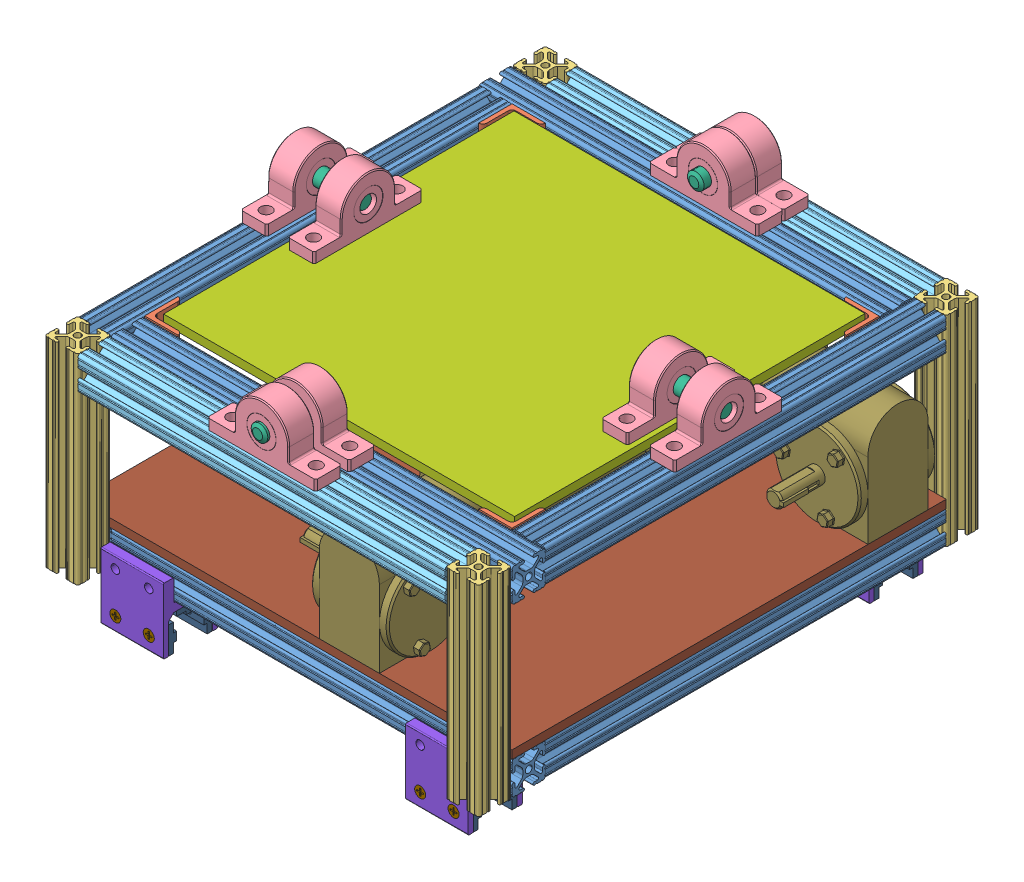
SolidWorks assembly Platform doneishish.SLDASM, configuration Default (file format 9000). Lengths in mm.
Overall size (330.24 225.54 383.98).
83 component instances, 12 part files, 93 mates.
Components (placement in the parent):
- Beams12in-4: Beams12in.sldprt [Default] at (271.7397 349.7495 462.1687) x (0 0 -1) z (1 0 0) size (25.4 25.4 304.8)
- Beams12in-5: Beams12in.sldprt [Default] at (259.0397 349.7495 144.6687) x (-1 0 0) z (0 0 -1) size (25.4 25.4 304.8)
- Beams12in-6: Beams12in.sldprt [Default] at (-45.7603 349.7495 170.0687) x (-1 0 0) z (0 0 -1) size (25.4 25.4 304.8)
- Beams12in-7: Beams12in.sldprt [Default] at (246.3397 349.7495 157.3687) x (0 0 -1) z (1 0 0) size (25.4 25.4 304.8)
- Corner bracket-1: Corner bracket.sldprt [Default] at (246.3397 349.7495 449.4687) x (0 -1 0) z (0 0 -1) size (25.4 25.4 25.4)
- Corner bracket-2: Corner bracket.sldprt [Default] at (-33.0603 349.7495 170.0687) x (0 1 0) z (1 0 0) size (25.4 25.4 25.4)
- Corner bracket-3: Corner bracket.sldprt [Default] at (246.3397 349.7495 170.0687) x (0 1 0) z (0 0 1) size (25.4 25.4 25.4)
- Corner bracket-4: Corner bracket.sldprt [Default] at (-33.0603 349.7495 449.4687) x (0 -1 0) z (1 0 0) size (25.4 25.4 25.4)
- Platform2-1: Platform2.SLDASM [Default] at (271.7213 476.6542 462.1369) x (0 0 -1) z (1 -0.000577 0) size (330.2 25.4 330.2)
  - Beams12in-7: Beams12in.sldprt [Default] at origin size (25.4 25.4 304.8)
  - Beams12in-5: Beams12in.sldprt [Default] at (317.5 0 -12.7) x (0 0 -1) z (1 0 0) size (25.4 25.4 304.8)
  - Beams12in-6: Beams12in.sldprt [Default] at (292.1 0 -317.5) x (0 0 -1) z (1 0 0) size (25.4 25.4 304.8)
  - Beams12in-8: Beams12in.sldprt [Default] at (304.8 0 -25.4) size (25.4 25.4 304.8)
  - Corner bracket-1: Corner bracket.sldprt [Default] at (12.7 0 -25.4) x (0 -1 0) z (1 0 0) size (25.4 25.4 25.4)
  - Corner bracket-2: Corner bracket.sldprt [Default] at (292.1 0 -304.8) x (0 1 0) z (0 0 1) size (25.4 25.4 25.4)
  - Corner bracket-3: Corner bracket.sldprt [Default] at (292.1 0 -25.4) x (0 1 0) z (-1 0 0) size (25.4 25.4 25.4)
  - Corner bracket-4: Corner bracket.sldprt [Default] at (12.7 0 -304.8) x (0 -1 0) z (0 0 1) size (25.4 25.4 25.4)
- Beams6in-1: Beams6in.sldprt [Default] at (259.0397 184.6495 131.9687) x (0 0 -1) z (0 -1 0) size (25.4 25.4 152.4)
- Beams6in-2: Beams6in.sldprt [Default] at (259.0397 184.6495 487.5687) x (0 0 -1) z (0 -1 0) size (25.4 25.4 152.4)
- Sleeve bearing 05diameter-1: Sleeve bearing 05diameter.SLDPRT [2820T6] at (106.6397 508.4995 154.5588) x (-1 0.000577 0) z (0 0 -1) size (82.55 39.69 19.84)
- Sleeve bearing 05diameter-2: Sleeve bearing 05diameter.SLDPRT [2820T6] at (106.6397 508.4995 464.915) x (1 -0.000577 0) z (0 0 1) size (82.55 39.69 19.84)
- Beams6in-3: Beams6in.sldprt [Default] at (-45.7603 184.6495 131.9687) x (0 0 -1) z (0 -1 0) size (25.4 25.4 152.4)
- Beams6in-4: Beams6in.sldprt [Default] at (-45.7603 184.6495 487.5687) x (0 0 -1) z (0 -1 0) size (25.4 25.4 152.4)
- Beams11in-6: Beams11in.sldprt [Default] at (271.7397 476.7495 487.5687) x (0 0 -1) z (1 0 0) size (25.4 25.4 279.4)
- Beams11in-7: Beams11in.sldprt [Default] at (271.7397 476.7495 131.9687) x (0 0 -1) z (1 0 0) size (25.4 25.4 279.4)
- Sleeve bearing 05diameter-3: Sleeve bearing 05diameter.SLDPRT [2820T6] at (106.6397 508.4995 490.3468) x (-1 0 0) z (0 0 -1) size (82.55 39.69 19.84)
- Sleeve bearing 05diameter-4: Sleeve bearing 05diameter.SLDPRT [2820T6] at (106.6397 508.4995 134.7468) x (-1 0 0) z (0 0 -1) size (82.55 39.69 19.84)
- Rod-1: Rod.SLDPRT [Default] at (106.6397 508.4995 503.2532) x (0.451188 0.892429 0) z (0 0 -1) size (12.7 12.7 50.8)
- Rod-2: Rod.SLDPRT [Default] at (106.6397 508.4995 171.5164) x (-0.988826 0.149076 0) z (0 0 -1) size (12.7 12.7 50.8)
- Sleeve bearing 05diameter-5: Sleeve bearing 05diameter.SLDPRT [2820T6] at (261.8178 508.4099 309.7687) x (0 0 -1) z (1 -0.000577 0) size (82.55 39.69 19.84)
- Sleeve bearing 05diameter-6: Sleeve bearing 05diameter.SLDPRT [2820T6] at (-48.5384 508.5891 309.7687) x (0 0 -1) z (1 -0.000577 0) size (82.55 39.69 19.84)
- Sleeve bearing 05diameter-7: Sleeve bearing 05diameter.SLDPRT [2820T6] at (225.7815 508.4307 309.7687) x (0.000001 0.001168 -0.999999) z (1 -0.000577 0) size (82.55 39.69 19.84)
- Sleeve bearing 05diameter-8: Sleeve bearing 05diameter.SLDPRT [2820T6] at (-12.5022 508.5683 309.7687) x (0.000001 0.001168 -0.999999) z (1 -0.000577 0) size (82.55 39.69 19.84)
- Rod-3: Rod.SLDPRT [Default] at (218.3997 508.435 309.7687) x (0.000225 0.390504 -0.920601) z (1 -0.000577 0) size (12.7 12.7 50.8)
- Rod-4: Rod.SLDPRT [Default] at (-55.9203 508.5933 309.7687) x (-0.000111 -0.191908 -0.981413) z (1 -0.000577 0) size (12.7 12.7 50.8)
- Plate-1: Plate.SLDPRT [Default] at (106.0122 483.1026 307.3752) x (-0.000787 0.001168 -0.999999) z (1 -0.000576 -0.000788) size (266.7 6.35 266.7)
- Linearbearing-1: Linearbearing.sldasm [Default] at (222.5272 314.0371 462.1687) x (0 0 -1) z (1 0 0) size (41.25 49.99 47.63)
  - _6715_p_2-1: _6715_p_2.sldprt [Default] at origin size (41.25 49.99 47.63)
  - _3625__4-1: _3625__4.sldprt [Default] at (-18.973 0 12.6873) x (0 0 -1) z (0 -1 0) size (8.43 1.79 8.43)
  - _3625__4-2: _3625__4.sldprt [Default] at (-18.973 0 -12.7127) x (0 0 -1) z (0 -1 0) size (8.43 1.79 8.43)
  - _3625__4-3: _3625__4.sldprt [Default] at (18.973 0 12.6873) x (0 0 -1) z (0 1 0) size (8.43 1.79 8.43)
  - _3625__4-4: _3625__4.sldprt [Default] at (18.973 0 -12.7127) x (0 0 -1) z (0 1 0) size (8.43 1.79 8.43)
  - _3625__4-5: _3625__4.sldprt [Default] at (0 19.5826 12.6873) x (1 0 0) z (0 0 -1) size (8.43 1.79 8.43)
  - _3625__4-6: _3625__4.sldprt [Default] at (0 19.5826 -12.7127) x (1 0 0) z (0 0 -1) size (8.43 1.79 8.43)
  - _6790_11-1: _6790_11.sldprt [Default] at (-12.8524 0 -0.0254) x (0 0 -1) z (1 0 0) size (47.37 20.62 6.35)
  - _6790_11-2: _6790_11.sldprt [Default] at (12.8524 0 -0.0254) x (0 0 -1) z (-1 0 0) size (47.37 20.62 6.35)
  - _6790_11-3: _6790_11.sldprt [Default] at (0 12.8524 -0.0254) x (0 0 -1) z (0 -1 0) size (47.37 20.62 6.35)
- Linearbearing-2: Linearbearing.sldasm [Default] at (-9.2478 314.0371 462.1687) x (0 0 -1) z (1 0 0) size (41.25 49.99 47.63)
  - _6715_p_2-1: _6715_p_2.sldprt [Default] at origin size (41.25 49.99 47.63)
  - _3625__4-1: _3625__4.sldprt [Default] at (-18.973 0 12.6873) x (0 0 -1) z (0 -1 0) size (8.43 1.79 8.43)
  - _3625__4-2: _3625__4.sldprt [Default] at (-18.973 0 -12.7127) x (0 0 -1) z (0 -1 0) size (8.43 1.79 8.43)
  - _3625__4-3: _3625__4.sldprt [Default] at (18.973 0 12.6873) x (0 0 -1) z (0 1 0) size (8.43 1.79 8.43)
  - _3625__4-4: _3625__4.sldprt [Default] at (18.973 0 -12.7127) x (0 0 -1) z (0 1 0) size (8.43 1.79 8.43)
  - _3625__4-5: _3625__4.sldprt [Default] at (0 19.5826 12.6873) x (1 0 0) z (0 0 -1) size (8.43 1.79 8.43)
  - _3625__4-6: _3625__4.sldprt [Default] at (0 19.5826 -12.7127) x (1 0 0) z (0 0 -1) size (8.43 1.79 8.43)
  - _6790_11-1: _6790_11.sldprt [Default] at (-12.8524 0 -0.0254) x (0 0 -1) z (1 0 0) size (47.37 20.62 6.35)
  - _6790_11-2: _6790_11.sldprt [Default] at (12.8524 0 -0.0254) x (0 0 -1) z (-1 0 0) size (47.37 20.62 6.35)
  - _6790_11-3: _6790_11.sldprt [Default] at (0 12.8524 -0.0254) x (0 0 -1) z (0 -1 0) size (47.37 20.62 6.35)
- Linearbearing-3: Linearbearing.sldasm [Default] at (-9.2478 314.0371 157.3687) x (0 0 1) z (-1 0 0) size (41.25 49.99 47.63)
  - _6715_p_2-1: _6715_p_2.sldprt [Default] at origin size (41.25 49.99 47.63)
  - _3625__4-1: _3625__4.sldprt [Default] at (-18.973 0 12.6873) x (0 0 -1) z (0 -1 0) size (8.43 1.79 8.43)
  - _3625__4-2: _3625__4.sldprt [Default] at (-18.973 0 -12.7127) x (0 0 -1) z (0 -1 0) size (8.43 1.79 8.43)
  - _3625__4-3: _3625__4.sldprt [Default] at (18.973 0 12.6873) x (0 0 -1) z (0 1 0) size (8.43 1.79 8.43)
  - _3625__4-4: _3625__4.sldprt [Default] at (18.973 0 -12.7127) x (0 0 -1) z (0 1 0) size (8.43 1.79 8.43)
  - _3625__4-5: _3625__4.sldprt [Default] at (0 19.5826 12.6873) x (1 0 0) z (0 0 -1) size (8.43 1.79 8.43)
  - _3625__4-6: _3625__4.sldprt [Default] at (0 19.5826 -12.7127) x (1 0 0) z (0 0 -1) size (8.43 1.79 8.43)
  - _6790_11-1: _6790_11.sldprt [Default] at (-12.8524 0 -0.0254) x (0 0 -1) z (1 0 0) size (47.37 20.62 6.35)
  - _6790_11-2: _6790_11.sldprt [Default] at (12.8524 0 -0.0254) x (0 0 -1) z (-1 0 0) size (47.37 20.62 6.35)
  - _6790_11-3: _6790_11.sldprt [Default] at (0 12.8524 -0.0254) x (0 0 -1) z (0 -1 0) size (47.37 20.62 6.35)
- Linearbearing-4: Linearbearing.sldasm [Default] at (222.5272 314.0371 157.3687) x (0 0 1) z (-1 0 0) size (41.25 49.99 47.63)
  - _6715_p_2-1: _6715_p_2.sldprt [Default] at origin size (41.25 49.99 47.63)
  - _3625__4-1: _3625__4.sldprt [Default] at (-18.973 0 12.6873) x (0 0 -1) z (0 -1 0) size (8.43 1.79 8.43)
  - _3625__4-2: _3625__4.sldprt [Default] at (-18.973 0 -12.7127) x (0 0 -1) z (0 -1 0) size (8.43 1.79 8.43)
  - _3625__4-3: _3625__4.sldprt [Default] at (18.973 0 12.6873) x (0 0 -1) z (0 1 0) size (8.43 1.79 8.43)
  - _3625__4-4: _3625__4.sldprt [Default] at (18.973 0 -12.7127) x (0 0 -1) z (0 1 0) size (8.43 1.79 8.43)
  - _3625__4-5: _3625__4.sldprt [Default] at (0 19.5826 12.6873) x (1 0 0) z (0 0 -1) size (8.43 1.79 8.43)
  - _3625__4-6: _3625__4.sldprt [Default] at (0 19.5826 -12.7127) x (1 0 0) z (0 0 -1) size (8.43 1.79 8.43)
  - _6790_11-1: _6790_11.sldprt [Default] at (-12.8524 0 -0.0254) x (0 0 -1) z (1 0 0) size (47.37 20.62 6.35)
  - _6790_11-2: _6790_11.sldprt [Default] at (12.8524 0 -0.0254) x (0 0 -1) z (-1 0 0) size (47.37 20.62 6.35)
  - _6790_11-3: _6790_11.sldprt [Default] at (0 12.8524 -0.0254) x (0 0 -1) z (0 -1 0) size (47.37 20.62 6.35)
- bottom plate-1: bottom plate.SLDPRT [Default] at (106.6397 362.4495 309.7687) size (330.2 6.35 330.2)
- 59825K310_RIGHT-ANGLE SHAFT DC GEARMOTOR-1: 59825K310_RIGHT-ANGLE SHAFT DC GEARMOTOR.SLDPRT [59825K31] at (179.5377 427.2195 181.3098) size (223.17 90.17 100.08)
- 59825K310_RIGHT-ANGLE SHAFT DC GEARMOTOR-2: 59825K310_RIGHT-ANGLE SHAFT DC GEARMOTOR.SLDPRT [59825K31] at (148.0409 427.2195 382.6667) x (0 0 1) z (-1 0 0) size (223.17 90.17 100.08)
Mates (geometry in assembly coordinates):
- Coincident32: coincident anti-aligned: plane of bottom plate-1 through (106.6397 368.7995 309.7687) normal (0 1 0); plane of 59825K310_RIGHT-ANGLE SHAFT DC GEARMOTOR-1 through (271.7397 368.7995 204.1444) normal (0 -1 0)
- Coincident33: coincident anti-aligned: plane of bottom plate-1 through (106.6397 368.7995 309.7687) normal (0 1 0); plane of 59825K310_RIGHT-ANGLE SHAFT DC GEARMOTOR-2 through (125.2063 368.7995 474.8687) normal (0 -1 0)
- Coincident2: coincident anti-aligned: plane of Beams12in-4 through (-33.0603 356.0826 449.4687) normal (0 0 -1); plane of Corner bracket-1 through (246.3397 337.0495 449.4687) normal (0 0 1)
- Coincident34: coincident aligned: plane of Beams12in-4 through (-33.0603 362.4495 452.6183) normal (0 1 0); plane of Corner bracket-1 through (246.3397 362.4495 427.2437) normal (0 1 0)
- Coincident35: coincident anti-aligned: plane of Beams12in-4 through (-33.0603 356.0826 449.4687) normal (0 0 -1); plane of Beams12in-5 through (271.7397 339.6911 449.4687) normal (0 0 1)
- Coincident36: coincident aligned: plane of Beams12in-4 through (271.7397 339.6911 474.8687) normal (1 0 0); plane of Beams12in-5 through (271.7397 359.2999 449.4687) normal (1 0 0)
- Coincident37: coincident anti-aligned: plane of Beams12in-4 through (-33.0603 356.0826 449.4687) normal (0 0 -1); plane of Corner bracket-4 through (-7.6603 337.0495 449.4687) normal (0 0 1)
- Coincident38: coincident aligned: plane of Beams12in-4 through (-33.0603 362.4495 452.6183) normal (0 1 0); plane of Corner bracket-4 through (-10.8353 362.4495 449.4687) normal (0 1 0)
- Coincident40: coincident aligned: plane of Beams12in-4 through (-33.0603 337.0495 471.7191) normal (0 -1 0); plane of Beams6in-2 through (259.0397 337.0495 487.5687) normal (0 -1 0)
- Coincident41: coincident anti-aligned: plane of Beams12in-4 through (-33.0603 359.2999 474.8687) normal (0 0 1); plane of Beams6in-2 through (265.3728 489.4495 474.8687) normal (0 0 -1)
- Coincident45: coincident aligned: plane of Beams12in-4 through (271.7397 339.6911 474.8687) normal (1 0 0); plane of Beams6in-2 through (271.7397 489.4495 478.0183) normal (1 0 0)
- Coincident49: coincident anti-aligned: plane of Beams12in-4 through (-33.0603 359.2999 474.8687) normal (0 0 1); plane of Beams6in-4 through (-55.3107 489.4495 474.8687) normal (0 0 -1)
- Coincident4: coincident anti-aligned: plane of Beams12in-5 through (246.3397 356.0826 449.4687) normal (-1 0 0); plane of Corner bracket-1 through (246.3397 337.0495 424.0687) normal (1 0 0)
- Coincident50: coincident aligned: plane of Beams12in-5 through (249.4893 362.4495 449.4687) normal (0 1 0); plane of Corner bracket-1 through (246.3397 362.4495 427.2437) normal (0 1 0)
- Coincident51: coincident anti-aligned: plane of Beams12in-5 through (246.3397 356.0826 449.4687) normal (-1 0 0); plane of Beams12in-7 through (246.3397 339.6911 170.0687) normal (1 0 0)
- Coincident52: coincident aligned: plane of Beams12in-5 through (271.7397 339.6911 144.6687) normal (0 0 -1); plane of Beams12in-7 through (-58.4603 356.0826 144.6687) normal (0 0 -1)
- Coincident11: coincident aligned: plane of Beams12in-5 through (268.5901 337.0495 449.4687) normal (0 -1 0); plane of Beams12in-7 through (-58.4603 337.0495 151.0356) normal (0 -1 0)
- Coincident15: coincident anti-aligned: plane of Beams12in-5 through (246.3397 356.0826 449.4687) normal (-1 0 0); plane of Corner bracket-3 through (246.3397 362.4495 195.4687) normal (1 0 0)
- Coincident53: coincident aligned: plane of Beams12in-5 through (249.4893 362.4495 449.4687) normal (0 1 0); plane of Corner bracket-3 through (246.3397 362.4495 192.2937) normal (0 1 0)
- Coincident44: coincident aligned: plane of Beams12in-5 through (271.7397 343.4164 449.4687) normal (1 0 0); plane of Beams6in-1 through (271.7397 489.4495 138.3018) normal (1 0 0)
- Coincident54: coincident aligned: plane of Beams12in-6 through (-58.4603 356.0826 474.8687) normal (-1 0 0); plane of Beams12in-7 through (-58.4603 339.6911 170.0687) normal (-1 0 0)
- Coincident55: coincident anti-aligned: plane of Beams12in-6 through (-33.0603 339.6911 170.0687) normal (0 0 -1); plane of Beams12in-7 through (-58.4603 359.2999 170.0687) normal (0 0 1)
- Coincident56: coincident aligned: plane of Beams12in-6 through (-39.4272 362.4495 474.8687) normal (0 1 0); plane of Beams12in-7 through (-58.4603 362.4495 163.7018) normal (0 1 0)
- Coincident57: coincident anti-aligned: plane of Beams12in-6 through (-33.0603 359.2999 474.8687) normal (1 0 0); plane of Corner bracket-2 through (-33.0603 362.4495 170.0687) normal (-1 0 0)
- Coincident58: coincident anti-aligned: plane of Beams12in-6 through (-33.0603 359.2999 474.8687) normal (1 0 0); plane of Corner bracket-4 through (-33.0603 337.0495 449.4687) normal (-1 0 0)
- Coincident59: coincident aligned: plane of Beams12in-6 through (-58.4603 356.0826 474.8687) normal (-1 0 0); plane of Beams6in-4 through (-58.4603 489.4495 497.1191) normal (-1 0 0)
- Coincident60: coincident aligned: plane of Beams12in-6 through (-52.0934 337.0495 474.8687) normal (0 -1 0); plane of Beams6in-4 through (-45.7603 337.0495 487.5687) normal (0 -1 0)
- Coincident61: coincident anti-aligned: plane of Beams12in-7 through (-58.4603 359.2999 170.0687) normal (0 0 1); plane of Corner bracket-3 through (246.3397 362.4495 170.0687) normal (0 0 -1)
- Coincident62: coincident anti-aligned: plane of Beams12in-7 through (-58.4603 359.2999 170.0687) normal (0 0 1); plane of Corner bracket-2 through (-7.6603 362.4495 170.0687) normal (0 0 -1)
- Coincident63: coincident aligned: plane of Beams12in-7 through (-58.4603 362.4495 163.7018) normal (0 1 0); plane of Corner bracket-2 through (-10.8353 362.4495 170.0687) normal (0 1 0)
- Coincident42: coincident anti-aligned: plane of Beams12in-7 through (-58.4603 356.0826 144.6687) normal (0 0 -1); plane of Beams6in-1 through (268.5901 489.4495 144.6687) normal (0 0 1)
- Coincident43: coincident aligned: plane of Beams12in-7 through (-58.4603 337.0495 151.0356) normal (0 -1 0); plane of Beams6in-1 through (259.0397 337.0495 131.9687) normal (0 -1 0)
- Coincident46: coincident aligned: plane of Beams12in-7 through (-58.4603 339.6911 170.0687) normal (-1 0 0); plane of Beams6in-3 through (-58.4603 489.4495 125.6356) normal (-1 0 0)
- Coincident47: coincident anti-aligned: plane of Beams12in-7 through (-58.4603 356.0826 144.6687) normal (0 0 -1); plane of Beams6in-3 through (-52.0934 489.4495 144.6687) normal (0 0 1)
- Coincident48: coincident aligned: plane of Beams12in-7 through (-58.4603 337.0495 166.9191) normal (0 -1 0); plane of Beams6in-3 through (-45.7603 337.0495 131.9687) normal (0 -1 0)
- Coincident64: coincident aligned: plane of Platform2-1/Beams12in-8 through (-58.475 483.1779 144.6369) normal (0 0 -1); plane of Sleeve bearing 05diameter-1 through (106.6397 508.4995 144.6369) normal (0 0 -1)
- Coincident65: coincident anti-aligned: plane of Platform2-1/Beams12in-8 through (-58.4713 489.5448 163.67) normal (0.000577 1 0); plane of Sleeve bearing 05diameter-1 through (147.9037 489.4257 144.6369) normal (-0.000577 -1 0)
- Coincident66: coincident aligned: plane of Platform2-1/Beams12in-7 through (-33.0731 486.3805 474.8369) normal (0 0 1); plane of Sleeve bearing 05diameter-2 through (106.6397 508.4995 474.8369) normal (0 0 1)
- Coincident39: coincident anti-aligned: plane of Platform2-1/Beams12in-7 through (-33.0713 489.5301 468.47) normal (0.000577 1 0); plane of Sleeve bearing 05diameter-2 through (65.3537 489.4733 474.8369) normal (-0.000577 -1 0)
- Coincident67: coincident anti-aligned: plane of Platform2-1/Beams12in-5 through (249.4783 489.367 449.4369) normal (0.000577 1 0); plane of Sleeve bearing 05diameter-5 through (271.7287 489.3542 351.0437) normal (-0.000577 -1 0)
- Coincident68: coincident aligned: plane of Platform2-1/Beams12in-5 through (271.7268 486.2046 449.4369) normal (1 -0.000577 0); plane of Sleeve bearing 05diameter-5 through (271.7397 508.4042 309.7687) normal (1 -0.000577 0)
- Coincident69: coincident anti-aligned: plane of Platform2-1/Beams12in-6 through (-55.3217 489.543 474.8369) normal (0.000577 1 0); plane of Sleeve bearing 05diameter-6 through (-38.6275 489.5333 351.0437) normal (-0.000577 -1 0)
- Coincident70: coincident aligned: plane of Platform2-1/Beams12in-6 through (-58.475 483.1779 474.8369) normal (-1 0.000577 0); plane of Sleeve bearing 05diameter-6 through (-58.4603 508.5948 309.7687) normal (-1 0.000577 0)
- Lock5: lock: unknown of ?; unknown of Sleeve bearing 05diameter-2
- Lock6: lock: unknown of ?; unknown of Sleeve bearing 05diameter-1
- Coincident71: coincident aligned: plane of Beams6in-1 through (249.4893 489.4495 119.2687) normal (0 0 -1); plane of Beams11in-7 through (-33.0603 483.0826 119.2687) normal (0 0 -1)
- Coincident72: coincident anti-aligned: plane of Beams6in-1 through (246.3397 489.4495 125.6356) normal (-1 0 0); plane of Beams11in-7 through (246.3397 476.7495 131.9687) normal (1 0 0)
- Coincident73: coincident aligned: plane of Beams6in-1 through (248.9813 489.4495 144.6687) normal (0 1 0); plane of Beams11in-7 through (-33.0603 489.4495 138.3018) normal (0 1 0)
- Distance2: distance = 165.1 mm: plane of Beams6in-1 through (271.7397 489.4495 138.3018) normal (1 0 0); moEndPointRef_w of Rod-2
- Distance7: distance = 190.5 mm: moEndPointRef_w of Rod-3; plane of Beams6in-1 through (249.4893 489.4495 119.2687) normal (0 0 -1)
- Concentric5: concentric anti-aligned: cylinder of Sleeve bearing 05diameter-1 through (106.6397 508.4995 164.4807) axis (0 0 -1) radius 6.35; cylinder of Rod-2 through (106.6397 508.4995 120.7164) axis (0 0 1) radius 6.35
- Distance14: distance = 5.588 mm anti-aligned: plane of Sleeve bearing 05diameter-3 through (106.6397 508.4995 480.4249) normal (0 0 -1); plane of Sleeve bearing 05diameter-2 through (106.6397 508.4995 474.8369) normal (0 0 1)
- Distance8: distance = 190.5 mm: moEndPointRef_w of Rod-4; plane of Beams6in-3 through (-55.3107 489.4495 119.2687) normal (0 0 -1)
- Coincident74: coincident aligned: plane of Beams6in-4 through (-36.2099 489.4495 500.2687) normal (0 0 1); plane of Beams11in-6 through (-33.0603 486.2999 500.2687) normal (0 0 1)
- Coincident75: coincident aligned: plane of Beams6in-4 through (-55.8187 489.4495 500.2687) normal (0 1 0); plane of Beams11in-6 through (-33.0603 489.4495 478.0183) normal (0 1 0)
- Coincident76: coincident anti-aligned: plane of Beams6in-4 through (-33.0603 489.4495 493.9018) normal (1 0 0); plane of Beams11in-6 through (-33.0603 466.6911 500.2687) normal (-1 0 0)
- Coincident77: coincident aligned: plane of Beams11in-6 through (-33.0603 486.2999 500.2687) normal (0 0 1); plane of Sleeve bearing 05diameter-3 through (106.6397 508.4995 500.2687) normal (0 0 1)
- Coincident78: coincident anti-aligned: plane of Beams11in-6 through (-33.0603 489.4495 478.0183) normal (0 1 0); plane of Sleeve bearing 05diameter-3 through (147.9147 489.4495 480.4249) normal (0 -1 0)
- Lock2: lock: unknown of Beams11in-6; unknown of Sleeve bearing 05diameter-3
- Coincident79: coincident anti-aligned: plane of Beams11in-7 through (-33.0603 489.4495 122.4183) normal (0 1 0); plane of Sleeve bearing 05diameter-4 through (147.9147 489.4495 124.8249) normal (0 -1 0)
- Coincident80: coincident aligned: plane of Beams11in-7 through (-33.0603 486.2999 144.6687) normal (0 0 1); plane of Sleeve bearing 05diameter-4 through (106.6397 508.4995 144.6687) normal (0 0 1)
- Lock3: lock: unknown of Sleeve bearing 05diameter-3; unknown of Rod-1
- Concentric3: concentric anti-aligned: cylinder of Sleeve bearing 05diameter-4 through (106.6397 508.4995 144.6687) axis (0 0 -1) radius 6.35; cylinder of Rod-2 through (106.6397 508.4995 120.7164) axis (0 0 1) radius 6.35
- Concentric6: concentric anti-aligned: cylinder of Sleeve bearing 05diameter-5 through (251.8959 508.4156 309.7687) axis (1 -0.000577 0) radius 6.35; cylinder of Rod-3 through (269.1997 508.4056 309.7687) axis (-1 0.000577 0) radius 6.35
- Distance10: distance = 2.54 mm aligned: plane of Rod-3 through (269.1997 508.4056 309.7687) normal (1 -0.000577 0); plane of Sleeve bearing 05diameter-5 through (271.7397 508.4042 309.7687) normal (1 -0.000577 0)
- Concentric8: concentric aligned: cylinder of Sleeve bearing 05diameter-6 through (-58.4603 508.5948 309.7687) axis (1 -0.000577 0) radius 6.35; cylinder of Sleeve bearing 05diameter-8 through (-22.424 508.574 309.7687) axis (1 -0.000577 0) radius 6.35
- Concentric9: concentric anti-aligned: cylinder of Sleeve bearing 05diameter-6 through (-58.4603 508.5948 309.7687) axis (1 -0.000577 0) radius 6.35; cylinder of Rod-4 through (-5.1203 508.564 309.7687) axis (-1 0.000577 0) radius 6.35
- Distance13: distance = 2.54 mm aligned: plane of Rod-4 through (-55.9203 508.5933 309.7687) normal (-1 0.000577 0); plane of Sleeve bearing 05diameter-6 through (-58.4603 508.5948 309.7687) normal (-1 0.000577 0)
- Concentric7: concentric anti-aligned: cylinder of Sleeve bearing 05diameter-7 through (215.8597 508.4364 309.7687) axis (1 -0.000577 0) radius 6.35; cylinder of Rod-3 through (269.1997 508.4056 309.7687) axis (-1 0.000577 0) radius 6.35
- Distance11: distance = 2.54 mm aligned: plane of Rod-3 through (218.3997 508.435 309.7687) normal (-1 0.000577 0); plane of Sleeve bearing 05diameter-7 through (215.8597 508.4364 309.7687) normal (-1 0.000577 0)
- Parallel3: parallel aligned: plane of Sleeve bearing 05diameter-7 through (235.6924 489.3268 351.0214) normal (-0.000577 -0.999999 -0.001168); plane of Plate-1 through (106.0122 483.1026 307.3752) normal (-0.000577 -0.999999 -0.001168)
- Concentric11: concentric anti-aligned: cylinder of Sleeve bearing 05diameter-8 through (-22.424 508.574 309.7687) axis (1 -0.000577 0) radius 6.35; cylinder of Rod-4 through (-5.1203 508.564 309.7687) axis (-1 0.000577 0) radius 6.35
- Distance12: distance = 2.54 mm aligned: plane of Rod-4 through (-5.1203 508.564 309.7687) normal (1 -0.000577 0); plane of Sleeve bearing 05diameter-8 through (-2.5803 508.5625 309.7687) normal (1 -0.000577 0)
- Coincident86: coincident anti-aligned: plane of Sleeve bearing 05diameter-8 through (-2.5913 489.4643 351.0214) normal (-0.000577 -0.999999 -0.001168); plane of Plate-1 through (106.0158 489.4526 307.3826) normal (0.000577 0.999999 0.001168)
- Lock1: lock: unknown of Sleeve bearing 05diameter-8; unknown of Plate-1
- Coincident87: coincident anti-aligned: plane of Beams12in-4 through (-33.0603 343.4164 474.8687) normal (0 0 1); plane of Linearbearing-2/_6715_p_2-1 through (14.5647 337.0495 474.8687) normal (0 0 -1)
- Tangent2: tangent anti-aligned: cylinder of Beams12in-4 through (-33.0603 339.1577 472.7605) axis (-1 0 0) radius 2.1082; plane of Linearbearing-2/_6715_p_2-1 through (14.5647 337.0495 442.3059) normal (0 1 0)
- Coincident88: coincident aligned: plane of Beams12in-4 through (-33.0603 359.2999 474.8687) normal (0 0 1); plane of bottom plate-1 through (271.7397 368.7995 474.8687) normal (0 0 1)
- Coincident89: coincident aligned: plane of Beams12in-5 through (271.7397 359.2999 449.4687) normal (1 0 0); plane of 59825K310_RIGHT-ANGLE SHAFT DC GEARMOTOR-1 through (271.7397 450.0795 181.3098) normal (1 0 0)
- Coincident90: coincident anti-aligned: plane of Beams12in-6 through (-55.3107 362.4495 474.8687) normal (0 1 0); plane of bottom plate-1 through (106.6397 362.4495 309.7687) normal (0 -1 0)
- Coincident91: coincident aligned: plane of Beams12in-6 through (-58.4603 356.0826 474.8687) normal (-1 0 0); plane of bottom plate-1 through (-58.4603 368.7995 474.8687) normal (-1 0 0)
- Coincident92: coincident anti-aligned: plane of Beams6in-1 through (246.3397 489.4495 141.5191) normal (-1 0 0); plane of Linearbearing-4/_6715_p_2-1 through (246.3397 304.4867 137.5059) normal (1 0 0)
- Coincident93: coincident anti-aligned: plane of Beams6in-2 through (246.3397 489.4495 497.1191) normal (-1 0 0); plane of ? through (246.3397 278.4004 482.0315) normal (1 0 0)
- Coincident94: coincident anti-aligned: plane of Beams6in-3 through (-33.0603 489.4495 138.3018) normal (1 0 0); plane of Linearbearing-3/_6715_p_2-1 through (-33.0603 304.4867 137.5059) normal (-1 0 0)
- Coincident95: coincident anti-aligned: plane of Beams6in-4 through (-33.0603 489.4495 478.0183) normal (1 0 0); plane of Linearbearing-2/_6715_p_2-1 through (-33.0603 304.4867 482.0315) normal (-1 0 0)
- Coincident96: coincident aligned: plane of Beams12in-4 through (-33.0603 359.2999 474.8687) normal (0 0 1); plane of 59825K310_RIGHT-ANGLE SHAFT DC GEARMOTOR-2 through (148.0409 450.0795 474.8687) normal (0 0 1)
- Coincident97: coincident anti-aligned: plane of Beams6in-1 through (246.3397 489.4495 141.5191) normal (-1 0 0); plane of Linearbearing-4/_6715_p_2-1 through (246.3397 304.4867 137.5059) normal (1 0 0)
- Coincident98: coincident anti-aligned: plane of Beams12in-7 through (-58.4603 340.1991 144.6687) normal (0 0 -1); plane of Linearbearing-4/_6715_p_2-1 through (198.7147 337.0495 144.6687) normal (0 0 1)
- Coincident100: coincident anti-aligned: plane of Beams12in-7 through (-58.4603 337.0495 151.0356) normal (0 -1 0); plane of Linearbearing-3/_6715_p_2-1 through (-33.0603 337.0495 177.2315) normal (0 1 0)
- Coincident101: coincident anti-aligned: plane of Beams12in-7 through (-58.4603 356.0826 144.6687) normal (0 0 -1); plane of Linearbearing-3/_6715_p_2-1 through (-33.0603 337.0495 144.6687) normal (0 0 1)
- Coincident102: coincident anti-aligned: plane of Beams12in-7 through (-58.4603 337.0495 151.0356) normal (0 -1 0); plane of Linearbearing-4/_6715_p_2-1 through (198.7147 337.0495 177.2315) normal (0 1 0)
- Coincident103: coincident anti-aligned: plane of Beams12in-4 through (-33.0603 359.2999 474.8687) normal (0 0 1); plane of Linearbearing-1/_6715_p_2-1 through (246.3397 337.0495 474.8687) normal (0 0 -1)
- Coincident104: coincident anti-aligned: plane of Beams12in-4 through (-33.0603 337.0495 471.7191) normal (0 -1 0); plane of Linearbearing-1/_6715_p_2-1 through (246.3397 337.0495 442.3059) normal (0 1 0)
